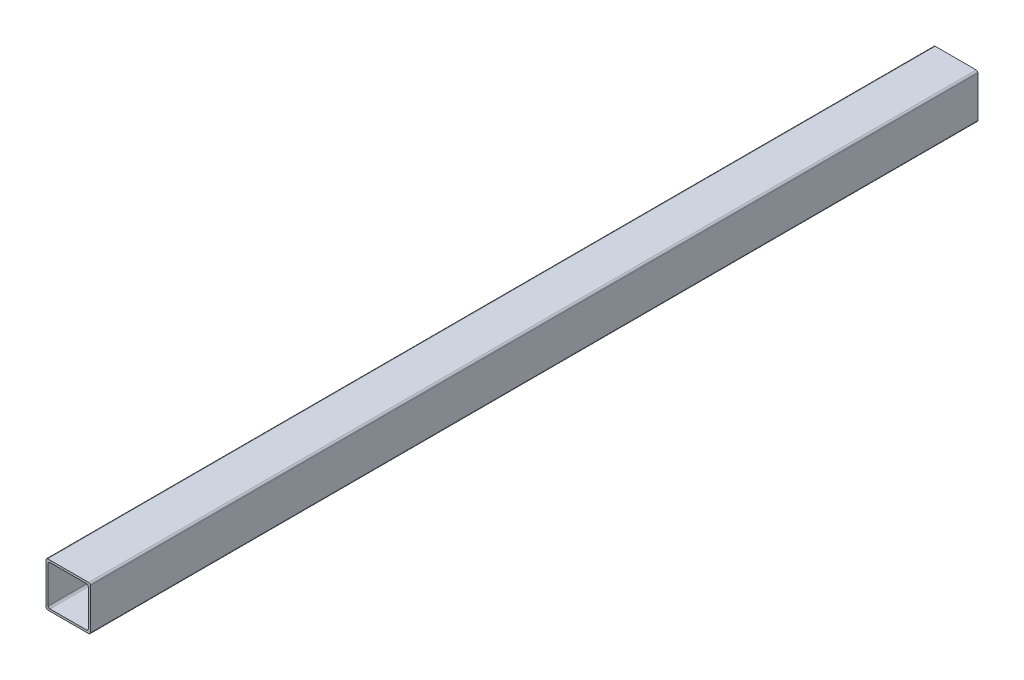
from build123d import *

# Parameters (mm, degrees)
EXTRUDE_1_DEPTH = 500


with BuildPart() as part:
    # Sketch 1 → Extrude 1 (new body)
    with BuildSketch(Plane.XY):
        with BuildLine():
            Line((-11.537, 12.5), (11.537, 12.5))
            ThreePointArc((11.537, 12.5), (12.21794383, 12.21794383), (12.5, 11.537))
            Line((12.5, 11.537), (12.5, -11.537))
            ThreePointArc((12.5, -11.537), (12.21794383, -12.21794383), (11.537, -12.5))
            Line((11.537, -12.5), (-11.537, -12.5))
            ThreePointArc((-11.537, -12.5), (-12.21794383, -12.21794383), (-12.5, -11.537))
            Line((-12.5, -11.537), (-12.5, 11.537))
            ThreePointArc((-12.5, 11.537), (-12.21794383, 12.21794383), (-11.537, 12.5))
        make_face()
        with BuildLine():
            Line((-10.337, 11.3), (10.337, 11.3))
            ThreePointArc((10.337, 11.3), (11.01794383, 11.01794383), (11.3, 10.337))
            Line((11.3, 10.337), (11.3, -10.337))
            ThreePointArc((11.3, -10.337), (11.01794383, -11.01794383), (10.337, -11.3))
            Line((10.337, -11.3), (-10.337, -11.3))
            ThreePointArc((-10.337, -11.3), (-11.01794383, -11.01794383), (-11.3, -10.337))
            Line((-11.3, -10.337), (-11.3, 10.337))
            ThreePointArc((-11.3, 10.337), (-11.01794383, 11.01794383), (-10.337, 11.3))
        make_face(mode=Mode.SUBTRACT)
    extrude(amount=EXTRUDE_1_DEPTH)


solid = part.part
